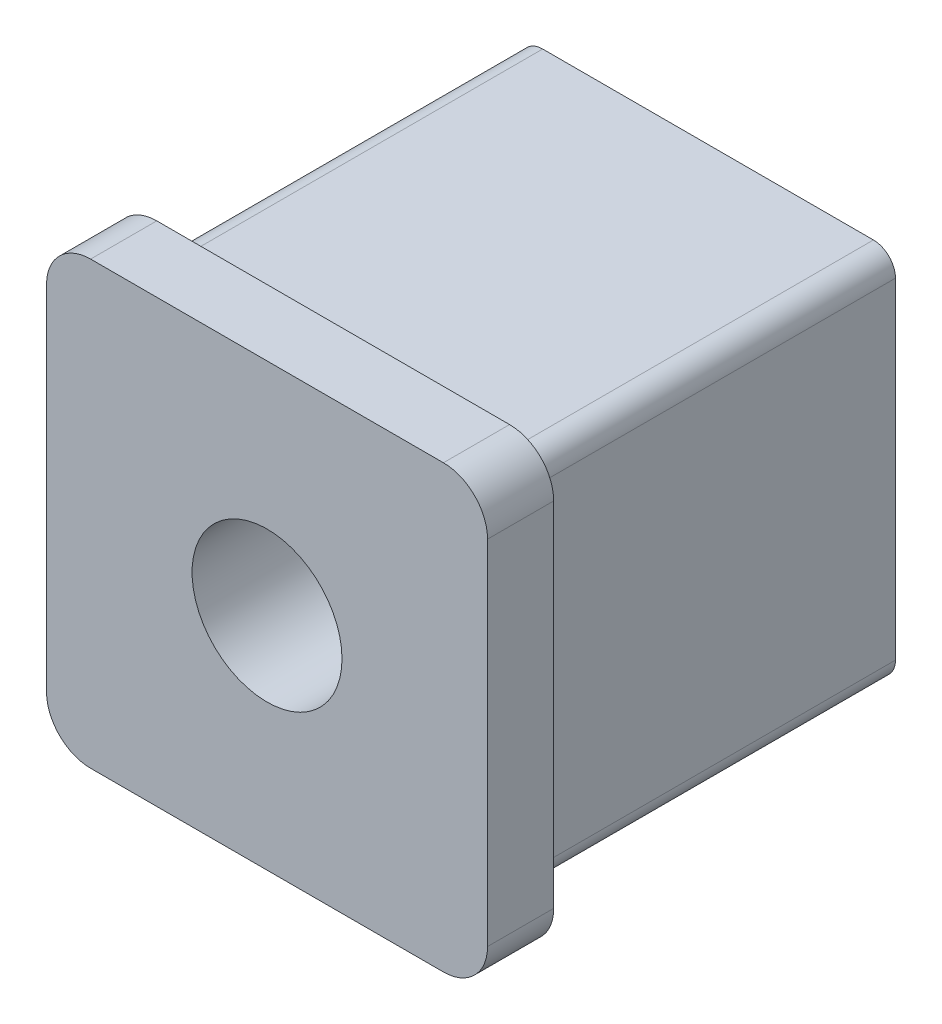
from build123d import *

# Parameters (mm, degrees)
EXTRUSION1_DEPTH       = 3
EXTRUSION2_DEPTH       = 17
TROU_TARAUD_M8X1_251_D = 6.8


with BuildPart() as part:
    # Esquisse1 → Extrusion1 (new body)
    with BuildSketch(Plane.XY):
        with BuildLine():
            Line((8, -10), (-8, -10))
            ThreePointArc((-8, -10), (-9.414213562, -9.414213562), (-10, -8))
            Line((-10, -8), (-10, 8))
            ThreePointArc((-10, 8), (-9.414213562, 9.414213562), (-8, 10))
            Line((-8, 10), (8, 10))
            ThreePointArc((8, 10), (9.414213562, 9.414213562), (10, 8))
            Line((10, 8), (10, -8))
            ThreePointArc((10, -8), (9.414213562, -9.414213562), (8, -10))
        make_face()
    extrude(amount=EXTRUSION1_DEPTH)

    # Esquisse2 → Extrusion2 (add)
    with BuildSketch(Plane(origin=(0, 0, 0), x_dir=(-1, 0, 0), z_dir=(0, 0, -1))):
        with BuildLine():
            Line((-7.5, 8.5), (7.5, 8.5))
            ThreePointArc((7.5, 8.5), (8.207106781, 8.207106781), (8.5, 7.5))
            Line((8.5, 7.5), (8.5, -7.5))
            ThreePointArc((8.5, -7.5), (8.207106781, -8.207106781), (7.5, -8.5))
            Line((7.5, -8.5), (-7.5, -8.5))
            ThreePointArc((-7.5, -8.5), (-8.207106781, -8.207106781), (-8.5, -7.5))
            Line((-8.5, -7.5), (-8.5, 7.5))
            ThreePointArc((-8.5, 7.5), (-8.207106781, 8.207106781), (-7.5, 8.5))
        make_face()
    extrude(amount=EXTRUSION2_DEPTH)

    # Trou taraud_ M8x1.251 (through all)
    with Locations(Plane.XY.offset(3)):
        with Locations((0, 0)):
            Hole(TROU_TARAUD_M8X1_251_D / 2)


solid = part.part
